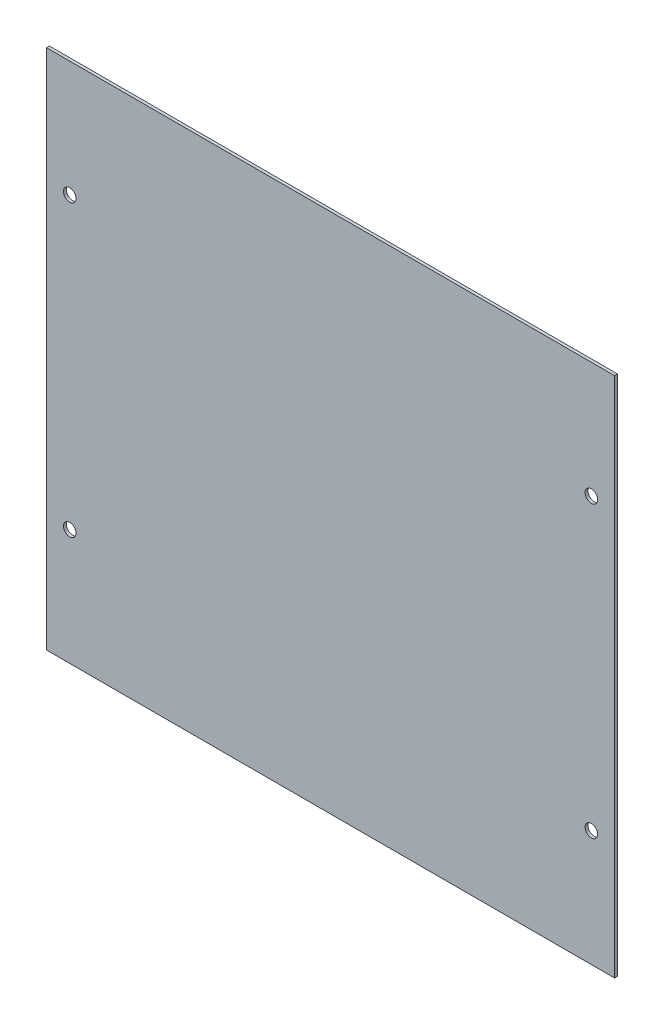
ISO-10303-21;
HEADER;
FILE_DESCRIPTION(('STEP AP214'),'2;1');
FILE_NAME('part.step','',(''),(''),'','','');
FILE_SCHEMA(('AUTOMOTIVE_DESIGN { 1 0 10303 214 1 1 1 1 }'));
ENDSEC;
DATA;
#1=APPLICATION_CONTEXT('core data for automotive mechanical design processes');
#2=APPLICATION_PROTOCOL_DEFINITION('international standard','automotive_design',2000,#1);
#3=PRODUCT_CONTEXT('',#1,'mechanical');
#4=PRODUCT('Part','Part','',(#3));
#5=PRODUCT_RELATED_PRODUCT_CATEGORY('part','',(#4));
#6=PRODUCT_DEFINITION_FORMATION('','',#4);
#7=PRODUCT_DEFINITION_CONTEXT('part definition',#1,'design');
#8=PRODUCT_DEFINITION('design','',#6,#7);
#9=PRODUCT_DEFINITION_SHAPE('','',#8);
#10=(LENGTH_UNIT() NAMED_UNIT(*) SI_UNIT(.MILLI.,.METRE.));
#11=(NAMED_UNIT(*) PLANE_ANGLE_UNIT() SI_UNIT($,.RADIAN.));
#12=(NAMED_UNIT(*) SI_UNIT($,.STERADIAN.) SOLID_ANGLE_UNIT());
#13=UNCERTAINTY_MEASURE_WITH_UNIT(LENGTH_MEASURE(1.E-05),#10,'distance_accuracy_value','');
#14=(GEOMETRIC_REPRESENTATION_CONTEXT(3) GLOBAL_UNCERTAINTY_ASSIGNED_CONTEXT((#13)) GLOBAL_UNIT_ASSIGNED_CONTEXT((#10,
#11,#12)) REPRESENTATION_CONTEXT('',''));
#15=CARTESIAN_POINT('',(0.,0.,0.));
#16=DIRECTION('',(0.,0.,1.));
#17=DIRECTION('',(1.,0.,0.));
#18=AXIS2_PLACEMENT_3D('',#15,#16,#17);
#19=CARTESIAN_POINT('',(0.,0.,1.5));
#20=DIRECTION('',(1.,0.,0.));
#21=DIRECTION('',(0.,0.,-1.));
#22=AXIS2_PLACEMENT_3D('',#19,#20,#21);
#23=PLANE('',#22);
#24=DIRECTION('',(0.,-1.,0.));
#25=VECTOR('',#24,1.);
#26=CARTESIAN_POINT('',(0.,0.,0.));
#27=LINE('',#26,#25);
#28=CARTESIAN_POINT('',(0.,270.,0.));
#29=VERTEX_POINT('',#28);
#30=CARTESIAN_POINT('',(0.,0.,0.));
#31=VERTEX_POINT('',#30);
#32=EDGE_CURVE('E98',#29,#31,#27,.T.);
#33=ORIENTED_EDGE('',*,*,#32,.T.);
#34=DIRECTION('',(0.,0.,-1.));
#35=VECTOR('',#34,1.);
#36=CARTESIAN_POINT('',(0.,0.,1.5));
#37=LINE('',#36,#35);
#38=CARTESIAN_POINT('',(0.,0.,1.5));
#39=VERTEX_POINT('',#38);
#40=EDGE_CURVE('E11',#39,#31,#37,.T.);
#41=ORIENTED_EDGE('',*,*,#40,.F.);
#42=DIRECTION('',(0.,-1.,0.));
#43=VECTOR('',#42,1.);
#44=CARTESIAN_POINT('',(0.,0.,1.5));
#45=LINE('',#44,#43);
#46=CARTESIAN_POINT('',(0.,270.,1.5));
#47=VERTEX_POINT('',#46);
#48=EDGE_CURVE('E86',#47,#39,#45,.T.);
#49=ORIENTED_EDGE('',*,*,#48,.F.);
#50=DIRECTION('',(0.,0.,-1.));
#51=VECTOR('',#50,1.);
#52=CARTESIAN_POINT('',(0.,270.,1.5));
#53=LINE('',#52,#51);
#54=EDGE_CURVE('E94',#47,#29,#53,.T.);
#55=ORIENTED_EDGE('',*,*,#54,.T.);
#56=EDGE_LOOP('',(#33,#41,#49,#55));
#57=FACE_BOUND('',#56,.T.);
#58=ADVANCED_FACE('F35',(#57),#23,.F.);
#59=CARTESIAN_POINT('',(0.,0.,1.5));
#60=DIRECTION('',(0.,1.,0.));
#61=DIRECTION('',(0.,0.,1.));
#62=AXIS2_PLACEMENT_3D('',#59,#60,#61);
#63=PLANE('',#62);
#64=DIRECTION('',(1.,0.,0.));
#65=VECTOR('',#64,1.);
#66=CARTESIAN_POINT('',(0.,0.,0.));
#67=LINE('',#66,#65);
#68=CARTESIAN_POINT('',(294.,0.,0.));
#69=VERTEX_POINT('',#68);
#70=EDGE_CURVE('E90',#31,#69,#67,.T.);
#71=ORIENTED_EDGE('',*,*,#70,.T.);
#72=DIRECTION('',(0.,0.,-1.));
#73=VECTOR('',#72,1.);
#74=CARTESIAN_POINT('',(294.,0.,1.5));
#75=LINE('',#74,#73);
#76=CARTESIAN_POINT('',(294.,0.,1.5));
#77=VERTEX_POINT('',#76);
#78=EDGE_CURVE('E43',#77,#69,#75,.T.);
#79=ORIENTED_EDGE('',*,*,#78,.F.);
#80=DIRECTION('',(1.,0.,0.));
#81=VECTOR('',#80,1.);
#82=CARTESIAN_POINT('',(0.,0.,1.5));
#83=LINE('',#82,#81);
#84=EDGE_CURVE('E81',#39,#77,#83,.T.);
#85=ORIENTED_EDGE('',*,*,#84,.F.);
#86=ORIENTED_EDGE('',*,*,#40,.T.);
#87=EDGE_LOOP('',(#71,#79,#85,#86));
#88=FACE_BOUND('',#87,.T.);
#89=ADVANCED_FACE('F89',(#88),#63,.F.);
#90=CARTESIAN_POINT('',(294.,0.,1.5));
#91=DIRECTION('',(-1.,0.,0.));
#92=DIRECTION('',(0.,0.,1.));
#93=AXIS2_PLACEMENT_3D('',#90,#91,#92);
#94=PLANE('',#93);
#95=DIRECTION('',(0.,1.,0.));
#96=VECTOR('',#95,1.);
#97=CARTESIAN_POINT('',(294.,0.,0.));
#98=LINE('',#97,#96);
#99=CARTESIAN_POINT('',(294.,270.,0.));
#100=VERTEX_POINT('',#99);
#101=EDGE_CURVE('E68',#69,#100,#98,.T.);
#102=ORIENTED_EDGE('',*,*,#101,.T.);
#103=DIRECTION('',(0.,0.,-1.));
#104=VECTOR('',#103,1.);
#105=CARTESIAN_POINT('',(294.,270.,1.5));
#106=LINE('',#105,#104);
#107=CARTESIAN_POINT('',(294.,270.,1.5));
#108=VERTEX_POINT('',#107);
#109=EDGE_CURVE('E91',#108,#100,#106,.T.);
#110=ORIENTED_EDGE('',*,*,#109,.F.);
#111=DIRECTION('',(0.,1.,0.));
#112=VECTOR('',#111,1.);
#113=CARTESIAN_POINT('',(294.,0.,1.5));
#114=LINE('',#113,#112);
#115=EDGE_CURVE('E84',#77,#108,#114,.T.);
#116=ORIENTED_EDGE('',*,*,#115,.F.);
#117=ORIENTED_EDGE('',*,*,#78,.T.);
#118=EDGE_LOOP('',(#102,#110,#116,#117));
#119=FACE_BOUND('',#118,.T.);
#120=ADVANCED_FACE('F92',(#119),#94,.F.);
#121=CARTESIAN_POINT('',(0.,270.,1.5));
#122=DIRECTION('',(0.,-1.,0.));
#123=DIRECTION('',(0.,0.,-1.));
#124=AXIS2_PLACEMENT_3D('',#121,#122,#123);
#125=PLANE('',#124);
#126=DIRECTION('',(-1.,0.,0.));
#127=VECTOR('',#126,1.);
#128=CARTESIAN_POINT('',(0.,270.,0.));
#129=LINE('',#128,#127);
#130=EDGE_CURVE('E74',#100,#29,#129,.T.);
#131=ORIENTED_EDGE('',*,*,#130,.T.);
#132=ORIENTED_EDGE('',*,*,#54,.F.);
#133=DIRECTION('',(-1.,0.,0.));
#134=VECTOR('',#133,1.);
#135=CARTESIAN_POINT('',(0.,270.,1.5));
#136=LINE('',#135,#134);
#137=EDGE_CURVE('E51',#108,#47,#136,.T.);
#138=ORIENTED_EDGE('',*,*,#137,.F.);
#139=ORIENTED_EDGE('',*,*,#109,.T.);
#140=EDGE_LOOP('',(#131,#132,#138,#139));
#141=FACE_BOUND('',#140,.T.);
#142=ADVANCED_FACE('F106',(#141),#125,.F.);
#143=CARTESIAN_POINT('',(0.,0.,1.5));
#144=DIRECTION('',(0.,0.,-1.));
#145=DIRECTION('',(-1.,0.,0.));
#146=AXIS2_PLACEMENT_3D('',#143,#144,#145);
#147=PLANE('',#146);
#148=CARTESIAN_POINT('',(12.,210.,1.5));
#149=DIRECTION('',(0.,0.,-1.));
#150=DIRECTION('',(-1.,0.,0.));
#151=AXIS2_PLACEMENT_3D('',#148,#149,#150);
#152=CIRCLE('',#151,3.25);
#153=CARTESIAN_POINT('',(8.75,210.,1.5));
#154=VERTEX_POINT('',#153);
#155=EDGE_CURVE('E129',#154,#154,#152,.T.);
#156=ORIENTED_EDGE('',*,*,#155,.T.);
#157=EDGE_LOOP('',(#156));
#158=FACE_BOUND('',#157,.T.);
#159=CARTESIAN_POINT('',(12.,60.,1.5));
#160=DIRECTION('',(0.,0.,-1.));
#161=DIRECTION('',(-1.,0.,0.));
#162=AXIS2_PLACEMENT_3D('',#159,#160,#161);
#163=CIRCLE('',#162,3.25);
#164=CARTESIAN_POINT('',(8.75000000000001,60.,1.5));
#165=VERTEX_POINT('',#164);
#166=EDGE_CURVE('E123',#165,#165,#163,.T.);
#167=ORIENTED_EDGE('',*,*,#166,.T.);
#168=EDGE_LOOP('',(#167));
#169=FACE_BOUND('',#168,.T.);
#170=CARTESIAN_POINT('',(282.,210.,1.5));
#171=DIRECTION('',(0.,0.,-1.));
#172=DIRECTION('',(-1.,0.,0.));
#173=AXIS2_PLACEMENT_3D('',#170,#171,#172);
#174=CIRCLE('',#173,3.24999999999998);
#175=CARTESIAN_POINT('',(278.75,210.,1.5));
#176=VERTEX_POINT('',#175);
#177=EDGE_CURVE('E117',#176,#176,#174,.T.);
#178=ORIENTED_EDGE('',*,*,#177,.T.);
#179=EDGE_LOOP('',(#178));
#180=FACE_BOUND('',#179,.T.);
#181=CARTESIAN_POINT('',(282.,60.,1.5));
#182=DIRECTION('',(0.,0.,-1.));
#183=DIRECTION('',(-1.,0.,0.));
#184=AXIS2_PLACEMENT_3D('',#181,#182,#183);
#185=CIRCLE('',#184,3.24999999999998);
#186=CARTESIAN_POINT('',(278.75,60.,1.5));
#187=VERTEX_POINT('',#186);
#188=EDGE_CURVE('E101',#187,#187,#185,.T.);
#189=ORIENTED_EDGE('',*,*,#188,.T.);
#190=EDGE_LOOP('',(#189));
#191=FACE_BOUND('',#190,.T.);
#192=ORIENTED_EDGE('',*,*,#48,.T.);
#193=ORIENTED_EDGE('',*,*,#84,.T.);
#194=ORIENTED_EDGE('',*,*,#115,.T.);
#195=ORIENTED_EDGE('',*,*,#137,.T.);
#196=EDGE_LOOP('',(#192,#193,#194,#195));
#197=FACE_BOUND('',#196,.T.);
#198=ADVANCED_FACE('F82',(#158,#169,#180,#191,#197),#147,.F.);
#199=CARTESIAN_POINT('',(0.,0.,0.));
#200=DIRECTION('',(0.,0.,-1.));
#201=DIRECTION('',(-1.,0.,0.));
#202=AXIS2_PLACEMENT_3D('',#199,#200,#201);
#203=PLANE('',#202);
#204=CARTESIAN_POINT('',(12.,210.,0.));
#205=DIRECTION('',(0.,0.,1.));
#206=DIRECTION('',(1.,0.,0.));
#207=AXIS2_PLACEMENT_3D('',#204,#205,#206);
#208=CIRCLE('',#207,3.25);
#209=CARTESIAN_POINT('',(15.25,210.,0.));
#210=VERTEX_POINT('',#209);
#211=EDGE_CURVE('E132',#210,#210,#208,.T.);
#212=ORIENTED_EDGE('',*,*,#211,.T.);
#213=EDGE_LOOP('',(#212));
#214=FACE_BOUND('',#213,.T.);
#215=CARTESIAN_POINT('',(12.,60.,0.));
#216=DIRECTION('',(0.,0.,1.));
#217=DIRECTION('',(1.,0.,0.));
#218=AXIS2_PLACEMENT_3D('',#215,#216,#217);
#219=CIRCLE('',#218,3.25);
#220=CARTESIAN_POINT('',(15.25,60.,0.));
#221=VERTEX_POINT('',#220);
#222=EDGE_CURVE('E126',#221,#221,#219,.T.);
#223=ORIENTED_EDGE('',*,*,#222,.T.);
#224=EDGE_LOOP('',(#223));
#225=FACE_BOUND('',#224,.T.);
#226=CARTESIAN_POINT('',(282.,210.,0.));
#227=DIRECTION('',(0.,0.,1.));
#228=DIRECTION('',(1.,0.,0.));
#229=AXIS2_PLACEMENT_3D('',#226,#227,#228);
#230=CIRCLE('',#229,3.24999999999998);
#231=CARTESIAN_POINT('',(285.25,210.,0.));
#232=VERTEX_POINT('',#231);
#233=EDGE_CURVE('E120',#232,#232,#230,.T.);
#234=ORIENTED_EDGE('',*,*,#233,.T.);
#235=EDGE_LOOP('',(#234));
#236=FACE_BOUND('',#235,.T.);
#237=CARTESIAN_POINT('',(282.,60.,0.));
#238=DIRECTION('',(0.,0.,1.));
#239=DIRECTION('',(1.,0.,0.));
#240=AXIS2_PLACEMENT_3D('',#237,#238,#239);
#241=CIRCLE('',#240,3.24999999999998);
#242=CARTESIAN_POINT('',(285.25,60.,0.));
#243=VERTEX_POINT('',#242);
#244=EDGE_CURVE('E114',#243,#243,#241,.T.);
#245=ORIENTED_EDGE('',*,*,#244,.T.);
#246=EDGE_LOOP('',(#245));
#247=FACE_BOUND('',#246,.T.);
#248=ORIENTED_EDGE('',*,*,#32,.F.);
#249=ORIENTED_EDGE('',*,*,#130,.F.);
#250=ORIENTED_EDGE('',*,*,#101,.F.);
#251=ORIENTED_EDGE('',*,*,#70,.F.);
#252=EDGE_LOOP('',(#248,#249,#250,#251));
#253=FACE_BOUND('',#252,.T.);
#254=ADVANCED_FACE('F109',(#214,#225,#236,#247,#253),#203,.T.);
#255=CARTESIAN_POINT('',(282.,60.,1.5));
#256=DIRECTION('',(0.,0.,1.));
#257=DIRECTION('',(1.,0.,0.));
#258=AXIS2_PLACEMENT_3D('',#255,#256,#257);
#259=CYLINDRICAL_SURFACE('',#258,3.24999999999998);
#260=ORIENTED_EDGE('',*,*,#244,.F.);
#261=EDGE_LOOP('',(#260));
#262=FACE_BOUND('',#261,.T.);
#263=ORIENTED_EDGE('',*,*,#188,.F.);
#264=EDGE_LOOP('',(#263));
#265=FACE_BOUND('',#264,.T.);
#266=ADVANCED_FACE('F154',(#262,#265),#259,.F.);
#267=CARTESIAN_POINT('',(282.,210.,1.5));
#268=DIRECTION('',(0.,0.,1.));
#269=DIRECTION('',(1.,0.,0.));
#270=AXIS2_PLACEMENT_3D('',#267,#268,#269);
#271=CYLINDRICAL_SURFACE('',#270,3.24999999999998);
#272=ORIENTED_EDGE('',*,*,#233,.F.);
#273=EDGE_LOOP('',(#272));
#274=FACE_BOUND('',#273,.T.);
#275=ORIENTED_EDGE('',*,*,#177,.F.);
#276=EDGE_LOOP('',(#275));
#277=FACE_BOUND('',#276,.T.);
#278=ADVANCED_FACE('F156',(#274,#277),#271,.F.);
#279=CARTESIAN_POINT('',(12.,60.,1.5));
#280=DIRECTION('',(0.,0.,1.));
#281=DIRECTION('',(1.,0.,0.));
#282=AXIS2_PLACEMENT_3D('',#279,#280,#281);
#283=CYLINDRICAL_SURFACE('',#282,3.25);
#284=ORIENTED_EDGE('',*,*,#222,.F.);
#285=EDGE_LOOP('',(#284));
#286=FACE_BOUND('',#285,.T.);
#287=ORIENTED_EDGE('',*,*,#166,.F.);
#288=EDGE_LOOP('',(#287));
#289=FACE_BOUND('',#288,.T.);
#290=ADVANCED_FACE('F141',(#286,#289),#283,.F.);
#291=CARTESIAN_POINT('',(12.,210.,1.5));
#292=DIRECTION('',(0.,0.,1.));
#293=DIRECTION('',(1.,0.,0.));
#294=AXIS2_PLACEMENT_3D('',#291,#292,#293);
#295=CYLINDRICAL_SURFACE('',#294,3.25);
#296=ORIENTED_EDGE('',*,*,#211,.F.);
#297=EDGE_LOOP('',(#296));
#298=FACE_BOUND('',#297,.T.);
#299=ORIENTED_EDGE('',*,*,#155,.F.);
#300=EDGE_LOOP('',(#299));
#301=FACE_BOUND('',#300,.T.);
#302=ADVANCED_FACE('F138',(#298,#301),#295,.F.);
#303=CLOSED_SHELL('',(#58,#89,#120,#142,#198,#254,#266,#278,#290,#302));
#304=MANIFOLD_SOLID_BREP('B2',#303);
#305=ADVANCED_BREP_SHAPE_REPRESENTATION('',(#18,#304),#14);
#306=SHAPE_DEFINITION_REPRESENTATION(#9,#305);
ENDSEC;
END-ISO-10303-21;
